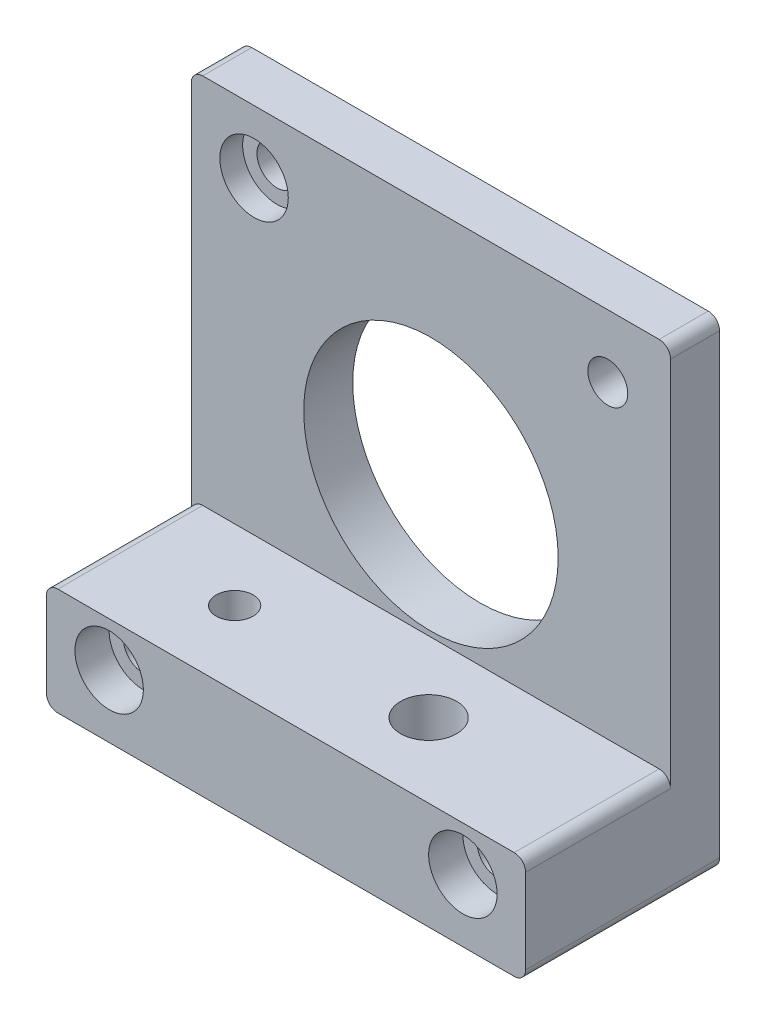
ISO-10303-21;
HEADER;
FILE_DESCRIPTION(('STEP AP214'),'2;1');
FILE_NAME('part.step','',(''),(''),'','','');
FILE_SCHEMA(('AUTOMOTIVE_DESIGN { 1 0 10303 214 1 1 1 1 }'));
ENDSEC;
DATA;
#1=APPLICATION_CONTEXT('core data for automotive mechanical design processes');
#2=APPLICATION_PROTOCOL_DEFINITION('international standard','automotive_design',2000,#1);
#3=PRODUCT_CONTEXT('',#1,'mechanical');
#4=PRODUCT('Part','Part','',(#3));
#5=PRODUCT_RELATED_PRODUCT_CATEGORY('part','',(#4));
#6=PRODUCT_DEFINITION_FORMATION('','',#4);
#7=PRODUCT_DEFINITION_CONTEXT('part definition',#1,'design');
#8=PRODUCT_DEFINITION('design','',#6,#7);
#9=PRODUCT_DEFINITION_SHAPE('','',#8);
#10=(LENGTH_UNIT() NAMED_UNIT(*) SI_UNIT(.MILLI.,.METRE.));
#11=(NAMED_UNIT(*) PLANE_ANGLE_UNIT() SI_UNIT($,.RADIAN.));
#12=(NAMED_UNIT(*) SI_UNIT($,.STERADIAN.) SOLID_ANGLE_UNIT());
#13=UNCERTAINTY_MEASURE_WITH_UNIT(LENGTH_MEASURE(1.E-05),#10,'distance_accuracy_value','');
#14=(GEOMETRIC_REPRESENTATION_CONTEXT(3) GLOBAL_UNCERTAINTY_ASSIGNED_CONTEXT((#13)) GLOBAL_UNIT_ASSIGNED_CONTEXT((#10,
#11,#12)) REPRESENTATION_CONTEXT('',''));
#15=CARTESIAN_POINT('',(0.,0.,0.));
#16=DIRECTION('',(0.,0.,1.));
#17=DIRECTION('',(1.,0.,0.));
#18=AXIS2_PLACEMENT_3D('',#15,#16,#17);
#19=CARTESIAN_POINT('',(21.,63.,4.3));
#20=DIRECTION('',(0.,0.,1.));
#21=DIRECTION('',(1.,0.,0.));
#22=AXIS2_PLACEMENT_3D('',#19,#20,#21);
#23=PLANE('',#22);
#24=CARTESIAN_POINT('',(21.,63.,4.3));
#25=DIRECTION('',(0.,0.,1.));
#26=DIRECTION('',(1.,0.,0.));
#27=AXIS2_PLACEMENT_3D('',#24,#25,#26);
#28=CIRCLE('',#27,11.15);
#29=CARTESIAN_POINT('',(32.15,63.,4.3));
#30=VERTEX_POINT('',#29);
#31=EDGE_CURVE('E11',#30,#30,#28,.T.);
#32=ORIENTED_EDGE('',*,*,#31,.F.);
#33=EDGE_LOOP('',(#32));
#34=FACE_BOUND('',#33,.T.);
#35=CARTESIAN_POINT('',(5.5,78.5,4.3));
#36=DIRECTION('',(0.,0.,1.));
#37=DIRECTION('',(1.,0.,0.));
#38=AXIS2_PLACEMENT_3D('',#35,#36,#37);
#39=CIRCLE('',#38,3.);
#40=CARTESIAN_POINT('',(8.5,78.5,4.3));
#41=VERTEX_POINT('',#40);
#42=EDGE_CURVE('E263',#41,#41,#39,.T.);
#43=ORIENTED_EDGE('',*,*,#42,.F.);
#44=EDGE_LOOP('',(#43));
#45=FACE_BOUND('',#44,.T.);
#46=CARTESIAN_POINT('',(36.5,78.5,4.3));
#47=DIRECTION('',(0.,0.,1.));
#48=DIRECTION('',(1.,0.,0.));
#49=AXIS2_PLACEMENT_3D('',#46,#47,#48);
#50=CIRCLE('',#49,1.75);
#51=CARTESIAN_POINT('',(38.25,78.5,4.3));
#52=VERTEX_POINT('',#51);
#53=EDGE_CURVE('E269',#52,#52,#50,.T.);
#54=ORIENTED_EDGE('',*,*,#53,.F.);
#55=EDGE_LOOP('',(#54));
#56=FACE_BOUND('',#55,.T.);
#57=CARTESIAN_POINT('',(1.,83.,4.3));
#58=DIRECTION('',(0.,0.,1.));
#59=DIRECTION('',(-0.707106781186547,0.707106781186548,0.));
#60=AXIS2_PLACEMENT_3D('',#57,#58,#59);
#61=CIRCLE('',#60,1.);
#62=CARTESIAN_POINT('',(1.,84.,4.3));
#63=VERTEX_POINT('',#62);
#64=CARTESIAN_POINT('',(0.,83.,4.3));
#65=VERTEX_POINT('',#64);
#66=EDGE_CURVE('E250',#63,#65,#61,.T.);
#67=ORIENTED_EDGE('',*,*,#66,.T.);
#68=DIRECTION('',(0.,1.,0.));
#69=VECTOR('',#68,1.);
#70=CARTESIAN_POINT('',(0.,42.,4.3));
#71=LINE('',#70,#69);
#72=CARTESIAN_POINT('',(0.,50.4,4.3));
#73=VERTEX_POINT('',#72);
#74=EDGE_CURVE('E278',#73,#65,#71,.T.);
#75=ORIENTED_EDGE('',*,*,#74,.F.);
#76=CARTESIAN_POINT('',(1.,50.4,4.3));
#77=DIRECTION('',(0.,0.,-1.));
#78=DIRECTION('',(-0.707106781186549,0.707106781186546,0.));
#79=AXIS2_PLACEMENT_3D('',#76,#77,#78);
#80=CIRCLE('',#79,1.);
#81=CARTESIAN_POINT('',(1.,51.4,4.3));
#82=VERTEX_POINT('',#81);
#83=EDGE_CURVE('E303',#73,#82,#80,.T.);
#84=ORIENTED_EDGE('',*,*,#83,.T.);
#85=DIRECTION('',(-1.,0.,0.));
#86=VECTOR('',#85,1.);
#87=CARTESIAN_POINT('',(10.5,51.4,4.3));
#88=LINE('',#87,#86);
#89=CARTESIAN_POINT('',(41.,51.4,4.3));
#90=VERTEX_POINT('',#89);
#91=EDGE_CURVE('E288',#90,#82,#88,.T.);
#92=ORIENTED_EDGE('',*,*,#91,.F.);
#93=CARTESIAN_POINT('',(41.,50.4,4.3));
#94=DIRECTION('',(0.,0.,-1.));
#95=DIRECTION('',(0.707106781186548,0.707106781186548,0.));
#96=AXIS2_PLACEMENT_3D('',#93,#94,#95);
#97=CIRCLE('',#96,1.);
#98=CARTESIAN_POINT('',(42.,50.4,4.3));
#99=VERTEX_POINT('',#98);
#100=EDGE_CURVE('E200',#90,#99,#97,.T.);
#101=ORIENTED_EDGE('',*,*,#100,.T.);
#102=DIRECTION('',(0.,-1.,0.));
#103=VECTOR('',#102,1.);
#104=CARTESIAN_POINT('',(42.,84.,4.3));
#105=LINE('',#104,#103);
#106=CARTESIAN_POINT('',(42.,83.,4.3));
#107=VERTEX_POINT('',#106);
#108=EDGE_CURVE('E194',#107,#99,#105,.T.);
#109=ORIENTED_EDGE('',*,*,#108,.F.);
#110=CARTESIAN_POINT('',(41.,83.,4.3));
#111=DIRECTION('',(0.,0.,1.));
#112=DIRECTION('',(0.707106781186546,0.707106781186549,0.));
#113=AXIS2_PLACEMENT_3D('',#110,#111,#112);
#114=CIRCLE('',#113,1.);
#115=CARTESIAN_POINT('',(41.,84.,4.3));
#116=VERTEX_POINT('',#115);
#117=EDGE_CURVE('E203',#107,#116,#114,.T.);
#118=ORIENTED_EDGE('',*,*,#117,.T.);
#119=DIRECTION('',(1.,0.,0.));
#120=VECTOR('',#119,1.);
#121=CARTESIAN_POINT('',(0.,84.,4.3));
#122=LINE('',#121,#120);
#123=EDGE_CURVE('E231',#63,#116,#122,.T.);
#124=ORIENTED_EDGE('',*,*,#123,.F.);
#125=EDGE_LOOP('',(#67,#75,#84,#92,#101,#109,#118,#124));
#126=FACE_BOUND('',#125,.T.);
#127=ADVANCED_FACE('F36',(#34,#45,#56,#126),#23,.T.);
#128=CARTESIAN_POINT('',(42.,42.,0.));
#129=DIRECTION('',(0.,-1.,0.));
#130=DIRECTION('',(-1.,0.,0.));
#131=AXIS2_PLACEMENT_3D('',#128,#129,#130);
#132=PLANE('',#131);
#133=CARTESIAN_POINT('',(27.,42.,10.5));
#134=DIRECTION('',(0.,-1.,0.));
#135=DIRECTION('',(1.,0.,0.));
#136=AXIS2_PLACEMENT_3D('',#133,#134,#135);
#137=CIRCLE('',#136,2.4585);
#138=CARTESIAN_POINT('',(29.4585,42.,10.5));
#139=VERTEX_POINT('',#138);
#140=EDGE_CURVE('E265',#139,#139,#137,.T.);
#141=ORIENTED_EDGE('',*,*,#140,.F.);
#142=EDGE_LOOP('',(#141));
#143=FACE_BOUND('',#142,.T.);
#144=CARTESIAN_POINT('',(10.,42.,10.5));
#145=DIRECTION('',(0.,-1.,0.));
#146=DIRECTION('',(1.,0.,0.));
#147=AXIS2_PLACEMENT_3D('',#144,#145,#146);
#148=CIRCLE('',#147,3.75);
#149=CARTESIAN_POINT('',(13.75,42.,10.5));
#150=VERTEX_POINT('',#149);
#151=EDGE_CURVE('E145',#150,#150,#148,.T.);
#152=ORIENTED_EDGE('',*,*,#151,.F.);
#153=EDGE_LOOP('',(#152));
#154=FACE_BOUND('',#153,.T.);
#155=DIRECTION('',(0.,0.,-1.));
#156=VECTOR('',#155,1.);
#157=CARTESIAN_POINT('',(1.,42.,0.));
#158=LINE('',#157,#156);
#159=CARTESIAN_POINT('',(1.,42.,17.));
#160=VERTEX_POINT('',#159);
#161=CARTESIAN_POINT('',(1.,42.,0.));
#162=VERTEX_POINT('',#161);
#163=EDGE_CURVE('E237',#160,#162,#158,.T.);
#164=ORIENTED_EDGE('',*,*,#163,.T.);
#165=DIRECTION('',(-1.,0.,0.));
#166=VECTOR('',#165,1.);
#167=CARTESIAN_POINT('',(42.,42.,0.));
#168=LINE('',#167,#166);
#169=CARTESIAN_POINT('',(41.,42.,0.));
#170=VERTEX_POINT('',#169);
#171=EDGE_CURVE('E249',#170,#162,#168,.T.);
#172=ORIENTED_EDGE('',*,*,#171,.F.);
#173=DIRECTION('',(0.,0.,1.));
#174=VECTOR('',#173,1.);
#175=CARTESIAN_POINT('',(41.,42.,0.));
#176=LINE('',#175,#174);
#177=CARTESIAN_POINT('',(41.,42.,17.));
#178=VERTEX_POINT('',#177);
#179=EDGE_CURVE('E216',#170,#178,#176,.T.);
#180=ORIENTED_EDGE('',*,*,#179,.T.);
#181=DIRECTION('',(-1.,0.,0.));
#182=VECTOR('',#181,1.);
#183=CARTESIAN_POINT('',(0.,42.,17.));
#184=LINE('',#183,#182);
#185=EDGE_CURVE('E220',#178,#160,#184,.T.);
#186=ORIENTED_EDGE('',*,*,#185,.T.);
#187=EDGE_LOOP('',(#164,#172,#180,#186));
#188=FACE_BOUND('',#187,.T.);
#189=ADVANCED_FACE('F376',(#143,#154,#188),#132,.T.);
#190=CARTESIAN_POINT('',(21.,63.,-57.481874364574));
#191=DIRECTION('',(0.,0.,-1.));
#192=DIRECTION('',(1.,0.,0.));
#193=AXIS2_PLACEMENT_3D('',#190,#191,#192);
#194=CYLINDRICAL_SURFACE('',#193,11.15);
#195=ORIENTED_EDGE('',*,*,#31,.T.);
#196=EDGE_LOOP('',(#195));
#197=FACE_BOUND('',#196,.T.);
#198=CARTESIAN_POINT('',(21.,63.,0.));
#199=DIRECTION('',(0.,0.,-1.));
#200=DIRECTION('',(1.,0.,0.));
#201=AXIS2_PLACEMENT_3D('',#198,#199,#200);
#202=CIRCLE('',#201,11.15);
#203=CARTESIAN_POINT('',(9.85,63.,0.));
#204=VERTEX_POINT('',#203);
#205=EDGE_CURVE('E239',#204,#204,#202,.T.);
#206=ORIENTED_EDGE('',*,*,#205,.T.);
#207=EDGE_LOOP('',(#206));
#208=FACE_BOUND('',#207,.T.);
#209=ADVANCED_FACE('F38',(#197,#208),#194,.F.);
#210=CARTESIAN_POINT('',(36.5,47.5,-44.781874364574));
#211=DIRECTION('',(0.,0.,-1.));
#212=DIRECTION('',(1.,0.,0.));
#213=AXIS2_PLACEMENT_3D('',#210,#211,#212);
#214=CYLINDRICAL_SURFACE('',#213,1.75);
#215=CARTESIAN_POINT('',(36.5,47.5,14.));
#216=DIRECTION('',(0.,0.,-1.));
#217=DIRECTION('',(1.,0.,0.));
#218=AXIS2_PLACEMENT_3D('',#215,#216,#217);
#219=CIRCLE('',#218,1.75);
#220=CARTESIAN_POINT('',(34.75,47.5,14.));
#221=VERTEX_POINT('',#220);
#222=EDGE_CURVE('E46',#221,#221,#219,.T.);
#223=ORIENTED_EDGE('',*,*,#222,.F.);
#224=EDGE_LOOP('',(#223));
#225=FACE_BOUND('',#224,.T.);
#226=CARTESIAN_POINT('',(36.5,47.5,0.));
#227=DIRECTION('',(0.,0.,-1.));
#228=DIRECTION('',(1.,0.,0.));
#229=AXIS2_PLACEMENT_3D('',#226,#227,#228);
#230=CIRCLE('',#229,1.75);
#231=CARTESIAN_POINT('',(34.75,47.5,0.));
#232=VERTEX_POINT('',#231);
#233=EDGE_CURVE('E242',#232,#232,#230,.T.);
#234=ORIENTED_EDGE('',*,*,#233,.T.);
#235=EDGE_LOOP('',(#234));
#236=FACE_BOUND('',#235,.T.);
#237=ADVANCED_FACE('F372',(#225,#236),#214,.F.);
#238=CARTESIAN_POINT('',(36.5,47.5,15.5));
#239=DIRECTION('',(0.,0.,-1.));
#240=DIRECTION('',(1.,0.,0.));
#241=AXIS2_PLACEMENT_3D('',#238,#239,#240);
#242=CYLINDRICAL_SURFACE('',#241,3.);
#243=CARTESIAN_POINT('',(36.5,47.5,14.));
#244=DIRECTION('',(0.,0.,-1.));
#245=DIRECTION('',(1.,0.,0.));
#246=AXIS2_PLACEMENT_3D('',#243,#244,#245);
#247=CIRCLE('',#246,3.);
#248=CARTESIAN_POINT('',(39.5,47.5,14.));
#249=VERTEX_POINT('',#248);
#250=EDGE_CURVE('E245',#249,#249,#247,.T.);
#251=ORIENTED_EDGE('',*,*,#250,.T.);
#252=EDGE_LOOP('',(#251));
#253=FACE_BOUND('',#252,.T.);
#254=CARTESIAN_POINT('',(36.5,47.5,17.));
#255=DIRECTION('',(0.,0.,1.));
#256=DIRECTION('',(1.,0.,0.));
#257=AXIS2_PLACEMENT_3D('',#254,#255,#256);
#258=CIRCLE('',#257,3.);
#259=CARTESIAN_POINT('',(39.5,47.5,17.));
#260=VERTEX_POINT('',#259);
#261=EDGE_CURVE('E321',#260,#260,#258,.T.);
#262=ORIENTED_EDGE('',*,*,#261,.T.);
#263=EDGE_LOOP('',(#262));
#264=FACE_BOUND('',#263,.T.);
#265=ADVANCED_FACE('F358',(#253,#264),#242,.F.);
#266=CARTESIAN_POINT('',(36.5,47.5,14.));
#267=DIRECTION('',(0.,0.,1.));
#268=DIRECTION('',(1.,0.,0.));
#269=AXIS2_PLACEMENT_3D('',#266,#267,#268);
#270=PLANE('',#269);
#271=ORIENTED_EDGE('',*,*,#222,.T.);
#272=EDGE_LOOP('',(#271));
#273=FACE_BOUND('',#272,.T.);
#274=ORIENTED_EDGE('',*,*,#250,.F.);
#275=EDGE_LOOP('',(#274));
#276=FACE_BOUND('',#275,.T.);
#277=ADVANCED_FACE('F361',(#273,#276),#270,.T.);
#278=CARTESIAN_POINT('',(5.5,47.5,-44.781874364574));
#279=DIRECTION('',(0.,0.,-1.));
#280=DIRECTION('',(1.,0.,0.));
#281=AXIS2_PLACEMENT_3D('',#278,#279,#280);
#282=CYLINDRICAL_SURFACE('',#281,1.75);
#283=CARTESIAN_POINT('',(5.5,47.5,14.));
#284=DIRECTION('',(0.,0.,-1.));
#285=DIRECTION('',(1.,0.,0.));
#286=AXIS2_PLACEMENT_3D('',#283,#284,#285);
#287=CIRCLE('',#286,1.75);
#288=CARTESIAN_POINT('',(3.75,47.5,14.));
#289=VERTEX_POINT('',#288);
#290=EDGE_CURVE('E262',#289,#289,#287,.T.);
#291=ORIENTED_EDGE('',*,*,#290,.F.);
#292=EDGE_LOOP('',(#291));
#293=FACE_BOUND('',#292,.T.);
#294=CARTESIAN_POINT('',(5.5,47.5,0.));
#295=DIRECTION('',(0.,0.,-1.));
#296=DIRECTION('',(1.,0.,0.));
#297=AXIS2_PLACEMENT_3D('',#294,#295,#296);
#298=CIRCLE('',#297,1.75);
#299=CARTESIAN_POINT('',(3.75,47.5,0.));
#300=VERTEX_POINT('',#299);
#301=EDGE_CURVE('E309',#300,#300,#298,.T.);
#302=ORIENTED_EDGE('',*,*,#301,.T.);
#303=EDGE_LOOP('',(#302));
#304=FACE_BOUND('',#303,.T.);
#305=ADVANCED_FACE('F363',(#293,#304),#282,.F.);
#306=CARTESIAN_POINT('',(5.5,47.5,15.5));
#307=DIRECTION('',(0.,0.,-1.));
#308=DIRECTION('',(1.,0.,0.));
#309=AXIS2_PLACEMENT_3D('',#306,#307,#308);
#310=CYLINDRICAL_SURFACE('',#309,3.);
#311=CARTESIAN_POINT('',(5.5,47.5,14.));
#312=DIRECTION('',(0.,0.,-1.));
#313=DIRECTION('',(1.,0.,0.));
#314=AXIS2_PLACEMENT_3D('',#311,#312,#313);
#315=CIRCLE('',#314,3.);
#316=CARTESIAN_POINT('',(8.5,47.5,14.));
#317=VERTEX_POINT('',#316);
#318=EDGE_CURVE('E259',#317,#317,#315,.T.);
#319=ORIENTED_EDGE('',*,*,#318,.T.);
#320=EDGE_LOOP('',(#319));
#321=FACE_BOUND('',#320,.T.);
#322=CARTESIAN_POINT('',(5.5,47.5,17.));
#323=DIRECTION('',(0.,0.,1.));
#324=DIRECTION('',(1.,0.,0.));
#325=AXIS2_PLACEMENT_3D('',#322,#323,#324);
#326=CIRCLE('',#325,3.);
#327=CARTESIAN_POINT('',(8.5,47.5,17.));
#328=VERTEX_POINT('',#327);
#329=EDGE_CURVE('E224',#328,#328,#326,.T.);
#330=ORIENTED_EDGE('',*,*,#329,.T.);
#331=EDGE_LOOP('',(#330));
#332=FACE_BOUND('',#331,.T.);
#333=ADVANCED_FACE('F369',(#321,#332),#310,.F.);
#334=CARTESIAN_POINT('',(5.5,47.5,14.));
#335=DIRECTION('',(0.,0.,1.));
#336=DIRECTION('',(1.,0.,0.));
#337=AXIS2_PLACEMENT_3D('',#334,#335,#336);
#338=PLANE('',#337);
#339=ORIENTED_EDGE('',*,*,#290,.T.);
#340=EDGE_LOOP('',(#339));
#341=FACE_BOUND('',#340,.T.);
#342=ORIENTED_EDGE('',*,*,#318,.F.);
#343=EDGE_LOOP('',(#342));
#344=FACE_BOUND('',#343,.T.);
#345=ADVANCED_FACE('F393',(#341,#344),#338,.T.);
#346=CARTESIAN_POINT('',(5.5,78.5,-57.481874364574));
#347=DIRECTION('',(0.,0.,-1.));
#348=DIRECTION('',(1.,0.,0.));
#349=AXIS2_PLACEMENT_3D('',#346,#347,#348);
#350=CYLINDRICAL_SURFACE('',#349,1.75);
#351=CARTESIAN_POINT('',(5.5,78.5,2.3));
#352=DIRECTION('',(0.,0.,-1.));
#353=DIRECTION('',(1.,0.,0.));
#354=AXIS2_PLACEMENT_3D('',#351,#352,#353);
#355=CIRCLE('',#354,1.75);
#356=CARTESIAN_POINT('',(3.75,78.5,2.3));
#357=VERTEX_POINT('',#356);
#358=EDGE_CURVE('E40',#357,#357,#355,.T.);
#359=ORIENTED_EDGE('',*,*,#358,.F.);
#360=EDGE_LOOP('',(#359));
#361=FACE_BOUND('',#360,.T.);
#362=CARTESIAN_POINT('',(5.5,78.5,0.));
#363=DIRECTION('',(0.,0.,-1.));
#364=DIRECTION('',(1.,0.,0.));
#365=AXIS2_PLACEMENT_3D('',#362,#363,#364);
#366=CIRCLE('',#365,1.75);
#367=CARTESIAN_POINT('',(3.75,78.5,0.));
#368=VERTEX_POINT('',#367);
#369=EDGE_CURVE('E272',#368,#368,#366,.T.);
#370=ORIENTED_EDGE('',*,*,#369,.T.);
#371=EDGE_LOOP('',(#370));
#372=FACE_BOUND('',#371,.T.);
#373=ADVANCED_FACE('F389',(#361,#372),#350,.F.);
#374=CARTESIAN_POINT('',(5.5,78.5,3.3));
#375=DIRECTION('',(0.,0.,-1.));
#376=DIRECTION('',(1.,0.,0.));
#377=AXIS2_PLACEMENT_3D('',#374,#375,#376);
#378=CYLINDRICAL_SURFACE('',#377,3.);
#379=CARTESIAN_POINT('',(5.5,78.5,2.3));
#380=DIRECTION('',(0.,0.,-1.));
#381=DIRECTION('',(1.,0.,0.));
#382=AXIS2_PLACEMENT_3D('',#379,#380,#381);
#383=CIRCLE('',#382,3.);
#384=CARTESIAN_POINT('',(8.5,78.5,2.3));
#385=VERTEX_POINT('',#384);
#386=EDGE_CURVE('E266',#385,#385,#383,.T.);
#387=ORIENTED_EDGE('',*,*,#386,.T.);
#388=EDGE_LOOP('',(#387));
#389=FACE_BOUND('',#388,.T.);
#390=ORIENTED_EDGE('',*,*,#42,.T.);
#391=EDGE_LOOP('',(#390));
#392=FACE_BOUND('',#391,.T.);
#393=ADVANCED_FACE('F392',(#389,#392),#378,.F.);
#394=CARTESIAN_POINT('',(5.5,78.5,2.3));
#395=DIRECTION('',(0.,0.,1.));
#396=DIRECTION('',(1.,0.,0.));
#397=AXIS2_PLACEMENT_3D('',#394,#395,#396);
#398=PLANE('',#397);
#399=ORIENTED_EDGE('',*,*,#358,.T.);
#400=EDGE_LOOP('',(#399));
#401=FACE_BOUND('',#400,.T.);
#402=ORIENTED_EDGE('',*,*,#386,.F.);
#403=EDGE_LOOP('',(#402));
#404=FACE_BOUND('',#403,.T.);
#405=ADVANCED_FACE('F387',(#401,#404),#398,.T.);
#406=CARTESIAN_POINT('',(36.5,78.5,-57.481874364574));
#407=DIRECTION('',(0.,0.,-1.));
#408=DIRECTION('',(1.,0.,0.));
#409=AXIS2_PLACEMENT_3D('',#406,#407,#408);
#410=CYLINDRICAL_SURFACE('',#409,1.75);
#411=ORIENTED_EDGE('',*,*,#53,.T.);
#412=EDGE_LOOP('',(#411));
#413=FACE_BOUND('',#412,.T.);
#414=CARTESIAN_POINT('',(36.5,78.5,0.));
#415=DIRECTION('',(0.,0.,-1.));
#416=DIRECTION('',(1.,0.,0.));
#417=AXIS2_PLACEMENT_3D('',#414,#415,#416);
#418=CIRCLE('',#417,1.75);
#419=CARTESIAN_POINT('',(34.75,78.5,0.));
#420=VERTEX_POINT('',#419);
#421=EDGE_CURVE('E270',#420,#420,#418,.T.);
#422=ORIENTED_EDGE('',*,*,#421,.T.);
#423=EDGE_LOOP('',(#422));
#424=FACE_BOUND('',#423,.T.);
#425=ADVANCED_FACE('F453',(#413,#424),#410,.F.);
#426=CARTESIAN_POINT('',(27.,103.781874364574,10.5));
#427=DIRECTION('',(0.,1.,0.));
#428=DIRECTION('',(1.,0.,0.));
#429=AXIS2_PLACEMENT_3D('',#426,#427,#428);
#430=CYLINDRICAL_SURFACE('',#429,2.4585);
#431=ORIENTED_EDGE('',*,*,#140,.T.);
#432=EDGE_LOOP('',(#431));
#433=FACE_BOUND('',#432,.T.);
#434=CARTESIAN_POINT('',(27.,51.4,10.5));
#435=DIRECTION('',(0.,1.,0.));
#436=DIRECTION('',(1.,0.,0.));
#437=AXIS2_PLACEMENT_3D('',#434,#435,#436);
#438=CIRCLE('',#437,2.4585);
#439=CARTESIAN_POINT('',(24.5415,51.4,10.5));
#440=VERTEX_POINT('',#439);
#441=EDGE_CURVE('E222',#440,#440,#438,.T.);
#442=ORIENTED_EDGE('',*,*,#441,.T.);
#443=EDGE_LOOP('',(#442));
#444=FACE_BOUND('',#443,.T.);
#445=ADVANCED_FACE('F411',(#433,#444),#430,.F.);
#446=CARTESIAN_POINT('',(10.,103.781874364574,10.5));
#447=DIRECTION('',(0.,1.,0.));
#448=DIRECTION('',(1.,0.,0.));
#449=AXIS2_PLACEMENT_3D('',#446,#447,#448);
#450=CYLINDRICAL_SURFACE('',#449,1.621);
#451=CARTESIAN_POINT('',(10.,44.5,10.5));
#452=DIRECTION('',(0.,1.,0.));
#453=DIRECTION('',(1.,0.,0.));
#454=AXIS2_PLACEMENT_3D('',#451,#452,#453);
#455=CIRCLE('',#454,1.621);
#456=CARTESIAN_POINT('',(8.379,44.5,10.5));
#457=VERTEX_POINT('',#456);
#458=EDGE_CURVE('E139',#457,#457,#455,.T.);
#459=ORIENTED_EDGE('',*,*,#458,.F.);
#460=EDGE_LOOP('',(#459));
#461=FACE_BOUND('',#460,.T.);
#462=CARTESIAN_POINT('',(10.,51.4,10.5));
#463=DIRECTION('',(0.,1.,0.));
#464=DIRECTION('',(1.,0.,0.));
#465=AXIS2_PLACEMENT_3D('',#462,#463,#464);
#466=CIRCLE('',#465,1.621);
#467=CARTESIAN_POINT('',(8.379,51.4,10.5));
#468=VERTEX_POINT('',#467);
#469=EDGE_CURVE('E223',#468,#468,#466,.T.);
#470=ORIENTED_EDGE('',*,*,#469,.T.);
#471=EDGE_LOOP('',(#470));
#472=FACE_BOUND('',#471,.T.);
#473=ADVANCED_FACE('F403',(#461,#472),#450,.F.);
#474=CARTESIAN_POINT('',(10.,43.25,10.5));
#475=DIRECTION('',(0.,1.,0.));
#476=DIRECTION('',(1.,0.,0.));
#477=AXIS2_PLACEMENT_3D('',#474,#475,#476);
#478=CYLINDRICAL_SURFACE('',#477,3.75);
#479=CARTESIAN_POINT('',(10.,44.5,10.5));
#480=DIRECTION('',(0.,1.,0.));
#481=DIRECTION('',(1.,0.,0.));
#482=AXIS2_PLACEMENT_3D('',#479,#480,#481);
#483=CIRCLE('',#482,3.75);
#484=CARTESIAN_POINT('',(13.75,44.5,10.5));
#485=VERTEX_POINT('',#484);
#486=EDGE_CURVE('E234',#485,#485,#483,.T.);
#487=ORIENTED_EDGE('',*,*,#486,.T.);
#488=EDGE_LOOP('',(#487));
#489=FACE_BOUND('',#488,.T.);
#490=ORIENTED_EDGE('',*,*,#151,.T.);
#491=EDGE_LOOP('',(#490));
#492=FACE_BOUND('',#491,.T.);
#493=ADVANCED_FACE('F400',(#489,#492),#478,.F.);
#494=CARTESIAN_POINT('',(10.,44.5,10.5));
#495=DIRECTION('',(0.,-1.,0.));
#496=DIRECTION('',(1.,0.,0.));
#497=AXIS2_PLACEMENT_3D('',#494,#495,#496);
#498=PLANE('',#497);
#499=ORIENTED_EDGE('',*,*,#458,.T.);
#500=EDGE_LOOP('',(#499));
#501=FACE_BOUND('',#500,.T.);
#502=ORIENTED_EDGE('',*,*,#486,.F.);
#503=EDGE_LOOP('',(#502));
#504=FACE_BOUND('',#503,.T.);
#505=ADVANCED_FACE('F402',(#501,#504),#498,.T.);
#506=CARTESIAN_POINT('',(0.,84.,0.));
#507=DIRECTION('',(0.,1.,0.));
#508=DIRECTION('',(1.,0.,0.));
#509=AXIS2_PLACEMENT_3D('',#506,#507,#508);
#510=PLANE('',#509);
#511=DIRECTION('',(0.,0.,1.));
#512=VECTOR('',#511,1.);
#513=CARTESIAN_POINT('',(1.,84.,0.));
#514=LINE('',#513,#512);
#515=CARTESIAN_POINT('',(1.,84.,0.));
#516=VERTEX_POINT('',#515);
#517=EDGE_CURVE('E273',#516,#63,#514,.T.);
#518=ORIENTED_EDGE('',*,*,#517,.T.);
#519=ORIENTED_EDGE('',*,*,#123,.T.);
#520=DIRECTION('',(0.,0.,-1.));
#521=VECTOR('',#520,1.);
#522=CARTESIAN_POINT('',(41.,84.,0.));
#523=LINE('',#522,#521);
#524=CARTESIAN_POINT('',(41.,84.,0.));
#525=VERTEX_POINT('',#524);
#526=EDGE_CURVE('E206',#116,#525,#523,.T.);
#527=ORIENTED_EDGE('',*,*,#526,.T.);
#528=DIRECTION('',(1.,0.,0.));
#529=VECTOR('',#528,1.);
#530=CARTESIAN_POINT('',(0.,84.,0.));
#531=LINE('',#530,#529);
#532=EDGE_CURVE('E274',#516,#525,#531,.T.);
#533=ORIENTED_EDGE('',*,*,#532,.F.);
#534=EDGE_LOOP('',(#518,#519,#527,#533));
#535=FACE_BOUND('',#534,.T.);
#536=ADVANCED_FACE('F430',(#535),#510,.T.);
#537=CARTESIAN_POINT('',(41.,83.,0.));
#538=DIRECTION('',(0.,0.,-1.));
#539=DIRECTION('',(0.707106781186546,0.707106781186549,0.));
#540=AXIS2_PLACEMENT_3D('',#537,#538,#539);
#541=CYLINDRICAL_SURFACE('',#540,1.);
#542=ORIENTED_EDGE('',*,*,#117,.F.);
#543=DIRECTION('',(0.,0.,1.));
#544=VECTOR('',#543,1.);
#545=CARTESIAN_POINT('',(42.,83.,0.));
#546=LINE('',#545,#544);
#547=CARTESIAN_POINT('',(42.,83.,0.));
#548=VERTEX_POINT('',#547);
#549=EDGE_CURVE('E188',#548,#107,#546,.T.);
#550=ORIENTED_EDGE('',*,*,#549,.F.);
#551=CARTESIAN_POINT('',(41.,83.,0.));
#552=DIRECTION('',(0.,0.,-1.));
#553=DIRECTION('',(0.707106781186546,0.707106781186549,0.));
#554=AXIS2_PLACEMENT_3D('',#551,#552,#553);
#555=CIRCLE('',#554,1.);
#556=EDGE_CURVE('E279',#525,#548,#555,.T.);
#557=ORIENTED_EDGE('',*,*,#556,.F.);
#558=ORIENTED_EDGE('',*,*,#526,.F.);
#559=EDGE_LOOP('',(#542,#550,#557,#558));
#560=FACE_BOUND('',#559,.T.);
#561=ADVANCED_FACE('F204',(#560),#541,.T.);
#562=CARTESIAN_POINT('',(41.,50.4,2.15));
#563=DIRECTION('',(0.,0.,-1.));
#564=DIRECTION('',(0.707106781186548,0.707106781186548,0.));
#565=AXIS2_PLACEMENT_3D('',#562,#563,#564);
#566=CYLINDRICAL_SURFACE('',#565,1.);
#567=CARTESIAN_POINT('',(41.,50.4,17.));
#568=DIRECTION('',(0.,0.,1.));
#569=DIRECTION('',(0.707106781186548,0.707106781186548,0.));
#570=AXIS2_PLACEMENT_3D('',#567,#568,#569);
#571=CIRCLE('',#570,1.);
#572=CARTESIAN_POINT('',(42.,50.4,17.));
#573=VERTEX_POINT('',#572);
#574=CARTESIAN_POINT('',(41.,51.4,17.));
#575=VERTEX_POINT('',#574);
#576=EDGE_CURVE('E226',#573,#575,#571,.T.);
#577=ORIENTED_EDGE('',*,*,#576,.F.);
#578=DIRECTION('',(0.,0.,1.));
#579=VECTOR('',#578,1.);
#580=CARTESIAN_POINT('',(42.,50.4,2.15));
#581=LINE('',#580,#579);
#582=EDGE_CURVE('E214',#99,#573,#581,.T.);
#583=ORIENTED_EDGE('',*,*,#582,.F.);
#584=ORIENTED_EDGE('',*,*,#100,.F.);
#585=DIRECTION('',(0.,0.,-1.));
#586=VECTOR('',#585,1.);
#587=CARTESIAN_POINT('',(41.,51.4,2.15));
#588=LINE('',#587,#586);
#589=EDGE_CURVE('E290',#575,#90,#588,.T.);
#590=ORIENTED_EDGE('',*,*,#589,.F.);
#591=EDGE_LOOP('',(#577,#583,#584,#590));
#592=FACE_BOUND('',#591,.T.);
#593=ADVANCED_FACE('F436',(#592),#566,.T.);
#594=CARTESIAN_POINT('',(42.,84.,0.));
#595=DIRECTION('',(1.,0.,0.));
#596=DIRECTION('',(0.,-1.,0.));
#597=AXIS2_PLACEMENT_3D('',#594,#595,#596);
#598=PLANE('',#597);
#599=DIRECTION('',(0.,0.,-1.));
#600=VECTOR('',#599,1.);
#601=CARTESIAN_POINT('',(42.,43.,0.));
#602=LINE('',#601,#600);
#603=CARTESIAN_POINT('',(42.,43.,17.));
#604=VERTEX_POINT('',#603);
#605=CARTESIAN_POINT('',(42.,43.,0.));
#606=VERTEX_POINT('',#605);
#607=EDGE_CURVE('E295',#604,#606,#602,.T.);
#608=ORIENTED_EDGE('',*,*,#607,.T.);
#609=DIRECTION('',(0.,-1.,0.));
#610=VECTOR('',#609,1.);
#611=CARTESIAN_POINT('',(42.,84.,0.));
#612=LINE('',#611,#610);
#613=EDGE_CURVE('E197',#548,#606,#612,.T.);
#614=ORIENTED_EDGE('',*,*,#613,.F.);
#615=ORIENTED_EDGE('',*,*,#549,.T.);
#616=ORIENTED_EDGE('',*,*,#108,.T.);
#617=ORIENTED_EDGE('',*,*,#582,.T.);
#618=DIRECTION('',(0.,-1.,0.));
#619=VECTOR('',#618,1.);
#620=CARTESIAN_POINT('',(42.,42.,17.));
#621=LINE('',#620,#619);
#622=EDGE_CURVE('E229',#573,#604,#621,.T.);
#623=ORIENTED_EDGE('',*,*,#622,.T.);
#624=EDGE_LOOP('',(#608,#614,#615,#616,#617,#623));
#625=FACE_BOUND('',#624,.T.);
#626=ADVANCED_FACE('F191',(#625),#598,.T.);
#627=CARTESIAN_POINT('',(41.,43.,0.));
#628=DIRECTION('',(0.,0.,-1.));
#629=DIRECTION('',(0.707106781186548,-0.707106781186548,0.));
#630=AXIS2_PLACEMENT_3D('',#627,#628,#629);
#631=CYLINDRICAL_SURFACE('',#630,1.);
#632=CARTESIAN_POINT('',(41.,43.,17.));
#633=DIRECTION('',(0.,0.,1.));
#634=DIRECTION('',(0.707106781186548,-0.707106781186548,0.));
#635=AXIS2_PLACEMENT_3D('',#632,#633,#634);
#636=CIRCLE('',#635,1.);
#637=EDGE_CURVE('E256',#178,#604,#636,.T.);
#638=ORIENTED_EDGE('',*,*,#637,.F.);
#639=ORIENTED_EDGE('',*,*,#179,.F.);
#640=CARTESIAN_POINT('',(41.,43.,0.));
#641=DIRECTION('',(0.,0.,-1.));
#642=DIRECTION('',(0.707106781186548,-0.707106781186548,0.));
#643=AXIS2_PLACEMENT_3D('',#640,#641,#642);
#644=CIRCLE('',#643,1.);
#645=EDGE_CURVE('E281',#606,#170,#644,.T.);
#646=ORIENTED_EDGE('',*,*,#645,.F.);
#647=ORIENTED_EDGE('',*,*,#607,.F.);
#648=EDGE_LOOP('',(#638,#639,#646,#647));
#649=FACE_BOUND('',#648,.T.);
#650=ADVANCED_FACE('F395',(#649),#631,.T.);
#651=CARTESIAN_POINT('',(0.,51.4,4.3));
#652=DIRECTION('',(0.,1.,0.));
#653=DIRECTION('',(1.,0.,0.));
#654=AXIS2_PLACEMENT_3D('',#651,#652,#653);
#655=PLANE('',#654);
#656=DIRECTION('',(0.,0.,1.));
#657=VECTOR('',#656,1.);
#658=CARTESIAN_POINT('',(1.,51.4,2.15));
#659=LINE('',#658,#657);
#660=CARTESIAN_POINT('',(1.,51.4,17.));
#661=VERTEX_POINT('',#660);
#662=EDGE_CURVE('E305',#82,#661,#659,.T.);
#663=ORIENTED_EDGE('',*,*,#662,.T.);
#664=DIRECTION('',(1.,0.,0.));
#665=VECTOR('',#664,1.);
#666=CARTESIAN_POINT('',(42.,51.4,17.));
#667=LINE('',#666,#665);
#668=EDGE_CURVE('E230',#661,#575,#667,.T.);
#669=ORIENTED_EDGE('',*,*,#668,.T.);
#670=ORIENTED_EDGE('',*,*,#589,.T.);
#671=ORIENTED_EDGE('',*,*,#91,.T.);
#672=EDGE_LOOP('',(#663,#669,#670,#671));
#673=FACE_BOUND('',#672,.T.);
#674=ORIENTED_EDGE('',*,*,#469,.F.);
#675=EDGE_LOOP('',(#674));
#676=FACE_BOUND('',#675,.T.);
#677=ORIENTED_EDGE('',*,*,#441,.F.);
#678=EDGE_LOOP('',(#677));
#679=FACE_BOUND('',#678,.T.);
#680=ADVANCED_FACE('F398',(#673,#676,#679),#655,.T.);
#681=CARTESIAN_POINT('',(21.,46.7,17.));
#682=DIRECTION('',(0.,0.,1.));
#683=DIRECTION('',(1.,0.,0.));
#684=AXIS2_PLACEMENT_3D('',#681,#682,#683);
#685=PLANE('',#684);
#686=ORIENTED_EDGE('',*,*,#329,.F.);
#687=EDGE_LOOP('',(#686));
#688=FACE_BOUND('',#687,.T.);
#689=ORIENTED_EDGE('',*,*,#261,.F.);
#690=EDGE_LOOP('',(#689));
#691=FACE_BOUND('',#690,.T.);
#692=CARTESIAN_POINT('',(1.,43.,17.));
#693=DIRECTION('',(0.,0.,1.));
#694=DIRECTION('',(-0.707106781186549,-0.707106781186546,0.));
#695=AXIS2_PLACEMENT_3D('',#692,#693,#694);
#696=CIRCLE('',#695,1.);
#697=CARTESIAN_POINT('',(0.,43.,17.));
#698=VERTEX_POINT('',#697);
#699=EDGE_CURVE('E235',#698,#160,#696,.T.);
#700=ORIENTED_EDGE('',*,*,#699,.T.);
#701=ORIENTED_EDGE('',*,*,#185,.F.);
#702=ORIENTED_EDGE('',*,*,#637,.T.);
#703=ORIENTED_EDGE('',*,*,#622,.F.);
#704=ORIENTED_EDGE('',*,*,#576,.T.);
#705=ORIENTED_EDGE('',*,*,#668,.F.);
#706=CARTESIAN_POINT('',(1.,50.4,17.));
#707=DIRECTION('',(0.,0.,1.));
#708=DIRECTION('',(-0.707106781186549,0.707106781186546,0.));
#709=AXIS2_PLACEMENT_3D('',#706,#707,#708);
#710=CIRCLE('',#709,1.);
#711=CARTESIAN_POINT('',(0.,50.4,17.));
#712=VERTEX_POINT('',#711);
#713=EDGE_CURVE('E285',#661,#712,#710,.T.);
#714=ORIENTED_EDGE('',*,*,#713,.T.);
#715=DIRECTION('',(0.,1.,0.));
#716=VECTOR('',#715,1.);
#717=CARTESIAN_POINT('',(0.,51.4,17.));
#718=LINE('',#717,#716);
#719=EDGE_CURVE('E319',#698,#712,#718,.T.);
#720=ORIENTED_EDGE('',*,*,#719,.F.);
#721=EDGE_LOOP('',(#700,#701,#702,#703,#704,#705,#714,#720));
#722=FACE_BOUND('',#721,.T.);
#723=ADVANCED_FACE('F408',(#688,#691,#722),#685,.T.);
#724=CARTESIAN_POINT('',(1.,50.4,2.15));
#725=DIRECTION('',(0.,0.,-1.));
#726=DIRECTION('',(-0.707106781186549,0.707106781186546,0.));
#727=AXIS2_PLACEMENT_3D('',#724,#725,#726);
#728=CYLINDRICAL_SURFACE('',#727,1.);
#729=ORIENTED_EDGE('',*,*,#713,.F.);
#730=ORIENTED_EDGE('',*,*,#662,.F.);
#731=ORIENTED_EDGE('',*,*,#83,.F.);
#732=DIRECTION('',(0.,0.,-1.));
#733=VECTOR('',#732,1.);
#734=CARTESIAN_POINT('',(0.,50.4,2.15));
#735=LINE('',#734,#733);
#736=EDGE_CURVE('E341',#712,#73,#735,.T.);
#737=ORIENTED_EDGE('',*,*,#736,.F.);
#738=EDGE_LOOP('',(#729,#730,#731,#737));
#739=FACE_BOUND('',#738,.T.);
#740=ADVANCED_FACE('F440',(#739),#728,.T.);
#741=CARTESIAN_POINT('',(1.,43.,0.));
#742=DIRECTION('',(0.,0.,-1.));
#743=DIRECTION('',(-0.707106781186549,-0.707106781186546,0.));
#744=AXIS2_PLACEMENT_3D('',#741,#742,#743);
#745=CYLINDRICAL_SURFACE('',#744,1.);
#746=ORIENTED_EDGE('',*,*,#699,.F.);
#747=DIRECTION('',(0.,0.,1.));
#748=VECTOR('',#747,1.);
#749=CARTESIAN_POINT('',(0.,43.,0.));
#750=LINE('',#749,#748);
#751=CARTESIAN_POINT('',(0.,43.,0.));
#752=VERTEX_POINT('',#751);
#753=EDGE_CURVE('E238',#752,#698,#750,.T.);
#754=ORIENTED_EDGE('',*,*,#753,.F.);
#755=CARTESIAN_POINT('',(1.,43.,0.));
#756=DIRECTION('',(0.,0.,-1.));
#757=DIRECTION('',(-0.707106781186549,-0.707106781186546,0.));
#758=AXIS2_PLACEMENT_3D('',#755,#756,#757);
#759=CIRCLE('',#758,1.);
#760=EDGE_CURVE('E246',#162,#752,#759,.T.);
#761=ORIENTED_EDGE('',*,*,#760,.F.);
#762=ORIENTED_EDGE('',*,*,#163,.F.);
#763=EDGE_LOOP('',(#746,#754,#761,#762));
#764=FACE_BOUND('',#763,.T.);
#765=ADVANCED_FACE('F437',(#764),#745,.T.);
#766=CARTESIAN_POINT('',(0.,42.,0.));
#767=DIRECTION('',(-1.,0.,0.));
#768=DIRECTION('',(0.,1.,0.));
#769=AXIS2_PLACEMENT_3D('',#766,#767,#768);
#770=PLANE('',#769);
#771=DIRECTION('',(0.,0.,-1.));
#772=VECTOR('',#771,1.);
#773=CARTESIAN_POINT('',(0.,83.,0.));
#774=LINE('',#773,#772);
#775=CARTESIAN_POINT('',(0.,83.,0.));
#776=VERTEX_POINT('',#775);
#777=EDGE_CURVE('E252',#65,#776,#774,.T.);
#778=ORIENTED_EDGE('',*,*,#777,.T.);
#779=DIRECTION('',(0.,1.,0.));
#780=VECTOR('',#779,1.);
#781=CARTESIAN_POINT('',(0.,42.,0.));
#782=LINE('',#781,#780);
#783=EDGE_CURVE('E241',#752,#776,#782,.T.);
#784=ORIENTED_EDGE('',*,*,#783,.F.);
#785=ORIENTED_EDGE('',*,*,#753,.T.);
#786=ORIENTED_EDGE('',*,*,#719,.T.);
#787=ORIENTED_EDGE('',*,*,#736,.T.);
#788=ORIENTED_EDGE('',*,*,#74,.T.);
#789=EDGE_LOOP('',(#778,#784,#785,#786,#787,#788));
#790=FACE_BOUND('',#789,.T.);
#791=ADVANCED_FACE('F423',(#790),#770,.T.);
#792=CARTESIAN_POINT('',(21.,63.,0.));
#793=DIRECTION('',(0.,0.,1.));
#794=DIRECTION('',(1.,0.,0.));
#795=AXIS2_PLACEMENT_3D('',#792,#793,#794);
#796=PLANE('',#795);
#797=CARTESIAN_POINT('',(1.,83.,0.));
#798=DIRECTION('',(0.,0.,-1.));
#799=DIRECTION('',(-0.707106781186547,0.707106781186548,0.));
#800=AXIS2_PLACEMENT_3D('',#797,#798,#799);
#801=CIRCLE('',#800,1.);
#802=EDGE_CURVE('E306',#776,#516,#801,.T.);
#803=ORIENTED_EDGE('',*,*,#802,.T.);
#804=ORIENTED_EDGE('',*,*,#532,.T.);
#805=ORIENTED_EDGE('',*,*,#556,.T.);
#806=ORIENTED_EDGE('',*,*,#613,.T.);
#807=ORIENTED_EDGE('',*,*,#645,.T.);
#808=ORIENTED_EDGE('',*,*,#171,.T.);
#809=ORIENTED_EDGE('',*,*,#760,.T.);
#810=ORIENTED_EDGE('',*,*,#783,.T.);
#811=EDGE_LOOP('',(#803,#804,#805,#806,#807,#808,#809,#810));
#812=FACE_BOUND('',#811,.T.);
#813=ORIENTED_EDGE('',*,*,#205,.F.);
#814=EDGE_LOOP('',(#813));
#815=FACE_BOUND('',#814,.T.);
#816=ORIENTED_EDGE('',*,*,#233,.F.);
#817=EDGE_LOOP('',(#816));
#818=FACE_BOUND('',#817,.T.);
#819=ORIENTED_EDGE('',*,*,#301,.F.);
#820=EDGE_LOOP('',(#819));
#821=FACE_BOUND('',#820,.T.);
#822=ORIENTED_EDGE('',*,*,#369,.F.);
#823=EDGE_LOOP('',(#822));
#824=FACE_BOUND('',#823,.T.);
#825=ORIENTED_EDGE('',*,*,#421,.F.);
#826=EDGE_LOOP('',(#825));
#827=FACE_BOUND('',#826,.T.);
#828=ADVANCED_FACE('F419',(#812,#815,#818,#821,#824,#827),#796,.F.);
#829=CARTESIAN_POINT('',(1.,83.,0.));
#830=DIRECTION('',(0.,0.,-1.));
#831=DIRECTION('',(-0.707106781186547,0.707106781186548,0.));
#832=AXIS2_PLACEMENT_3D('',#829,#830,#831);
#833=CYLINDRICAL_SURFACE('',#832,1.);
#834=ORIENTED_EDGE('',*,*,#66,.F.);
#835=ORIENTED_EDGE('',*,*,#517,.F.);
#836=ORIENTED_EDGE('',*,*,#802,.F.);
#837=ORIENTED_EDGE('',*,*,#777,.F.);
#838=EDGE_LOOP('',(#834,#835,#836,#837));
#839=FACE_BOUND('',#838,.T.);
#840=ADVANCED_FACE('F422',(#839),#833,.T.);
#841=CLOSED_SHELL('',(#127,#189,#209,#237,#265,#277,#305,#333,#345,#373,#393,#405,#425,#445,
#473,#493,#505,#536,#561,#593,#626,#650,#680,#723,#740,#765,#791,#828,#840));
#842=MANIFOLD_SOLID_BREP('B2',#841);
#843=ADVANCED_BREP_SHAPE_REPRESENTATION('',(#18,#842),#14);
#844=SHAPE_DEFINITION_REPRESENTATION(#9,#843);
ENDSEC;
END-ISO-10303-21;
